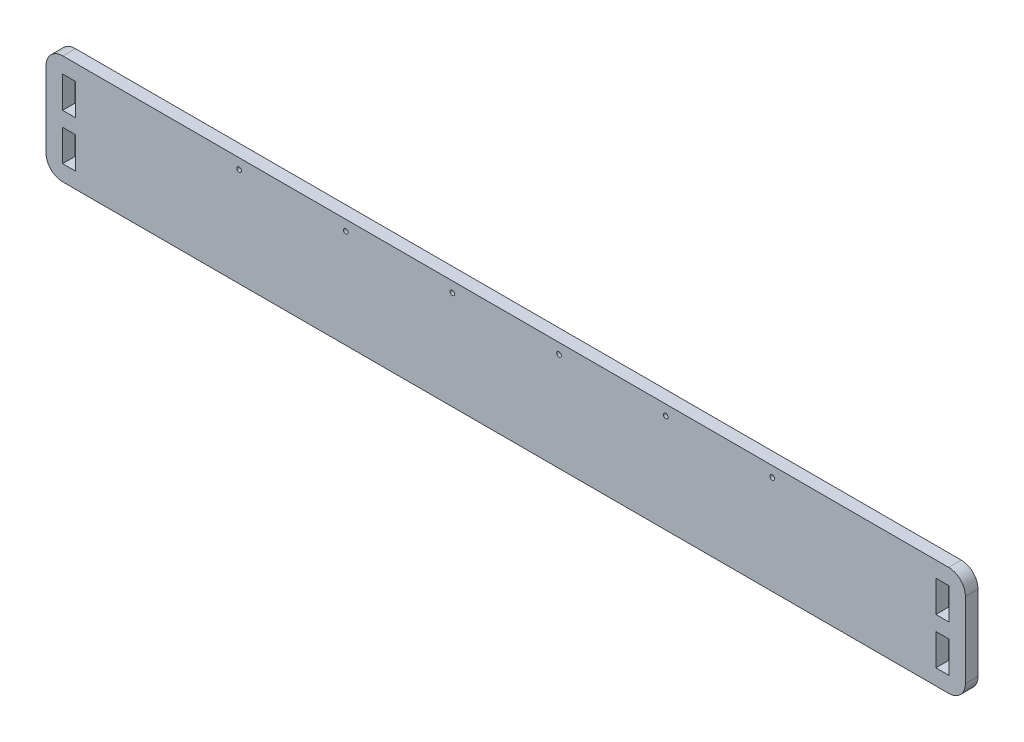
from build123d import *

# Parameters (mm, degrees)
SKETCH1_W                       = 438
SKETCH1_H                       = 52
BOSS_EXTRUDE1_DEPTH             = 6
SKETCH2_W                       = 6.2
SKETCH2_H                       = 15
HOLES_FOR_SIDE_PANEL_TABS_DEPTH = 228.149730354
FILLET1_R                       = 8
SKETCH3_R                       = 1.1
HINGE_SCREW_PILOT_HOLE_DEPTH    = 228.149730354


with BuildPart() as part:
    # Sketch1 → Boss-Extrude1 (new body)
    with BuildSketch(Plane.XY):
        with Locations((0, 34)):
            Rectangle(SKETCH1_W, SKETCH1_H)
    extrude(amount=BOSS_EXTRUDE1_DEPTH)

    # Sketch2 → holes for side panel tabs (cut, through all)
    with BuildSketch(Plane.XY.offset(6)):
        with Locations((-208, 45)):
            Rectangle(SKETCH2_W, SKETCH2_H)
        with Locations((-208, 23)):
            Rectangle(SKETCH2_W, SKETCH2_H)
        with Locations((208, 23)):
            Rectangle(SKETCH2_W, SKETCH2_H)
        with Locations((208, 45)):
            Rectangle(SKETCH2_W, SKETCH2_H)
    extrude(amount=-HOLES_FOR_SIDE_PANEL_TABS_DEPTH, mode=Mode.SUBTRACT)

    # Fillet1
    fillet1_edges = [part.edges().sort_by_distance(p)[0] for p in [
        (-219, 60, 3),
        (219, 60, 3),
        (219, 8, 3),
        (-219, 8, 3),
    ]]
    fillet(fillet1_edges, radius=FILLET1_R)

    # Sketch3 → hinge screw pilot hole (cut, through all)
    with BuildSketch(Plane(origin=(0, 0, 0), x_dir=(-1, 0, 0), z_dir=(0, 0, -1))):
        with Locations((-127, 55.06276)):
            Circle(SKETCH3_R)
        with Locations((-76.2, 55.06276)):
            Circle(SKETCH3_R)
        with Locations((-25.4, 55.06276)):
            Circle(SKETCH3_R)
        with Locations((25.4, 55.06276)):
            Circle(SKETCH3_R)
        with Locations((76.2, 55.06276)):
            Circle(SKETCH3_R)
        with Locations((127, 55.06276)):
            Circle(SKETCH3_R)
    extrude(amount=-HINGE_SCREW_PILOT_HOLE_DEPTH, mode=Mode.SUBTRACT)


solid = part.part
